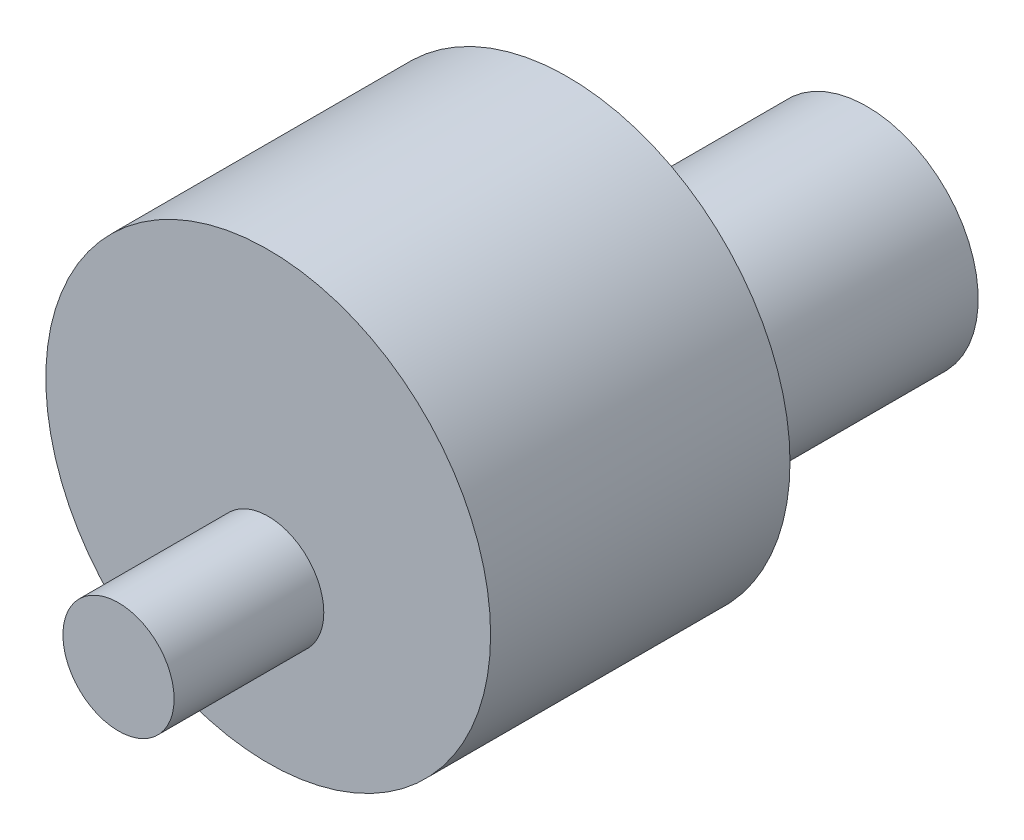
ISO-10303-21;
HEADER;
FILE_DESCRIPTION(('STEP AP214'),'2;1');
FILE_NAME('part.step','',(''),(''),'','','');
FILE_SCHEMA(('AUTOMOTIVE_DESIGN { 1 0 10303 214 1 1 1 1 }'));
ENDSEC;
DATA;
#1=APPLICATION_CONTEXT('core data for automotive mechanical design processes');
#2=APPLICATION_PROTOCOL_DEFINITION('international standard','automotive_design',2000,#1);
#3=PRODUCT_CONTEXT('',#1,'mechanical');
#4=PRODUCT('Part','Part','',(#3));
#5=PRODUCT_RELATED_PRODUCT_CATEGORY('part','',(#4));
#6=PRODUCT_DEFINITION_FORMATION('','',#4);
#7=PRODUCT_DEFINITION_CONTEXT('part definition',#1,'design');
#8=PRODUCT_DEFINITION('design','',#6,#7);
#9=PRODUCT_DEFINITION_SHAPE('','',#8);
#10=(LENGTH_UNIT() NAMED_UNIT(*) SI_UNIT(.MILLI.,.METRE.));
#11=(NAMED_UNIT(*) PLANE_ANGLE_UNIT() SI_UNIT($,.RADIAN.));
#12=(NAMED_UNIT(*) SI_UNIT($,.STERADIAN.) SOLID_ANGLE_UNIT());
#13=UNCERTAINTY_MEASURE_WITH_UNIT(LENGTH_MEASURE(1.E-05),#10,'distance_accuracy_value','');
#14=(GEOMETRIC_REPRESENTATION_CONTEXT(3) GLOBAL_UNCERTAINTY_ASSIGNED_CONTEXT((#13)) GLOBAL_UNIT_ASSIGNED_CONTEXT((#10,
#11,#12)) REPRESENTATION_CONTEXT('',''));
#15=CARTESIAN_POINT('',(0.,0.,0.));
#16=DIRECTION('',(0.,0.,1.));
#17=DIRECTION('',(1.,0.,0.));
#18=AXIS2_PLACEMENT_3D('',#15,#16,#17);
#19=CARTESIAN_POINT('',(0.,0.,177.8));
#20=DIRECTION('',(0.,0.,-1.));
#21=DIRECTION('',(-1.,0.,0.));
#22=AXIS2_PLACEMENT_3D('',#19,#20,#21);
#23=CYLINDRICAL_SURFACE('',#22,132.08);
#24=CARTESIAN_POINT('',(0.,0.,177.8));
#25=DIRECTION('',(0.,0.,1.));
#26=DIRECTION('',(1.,0.,0.));
#27=AXIS2_PLACEMENT_3D('',#24,#25,#26);
#28=CIRCLE('',#27,132.08);
#29=CARTESIAN_POINT('',(132.08,0.,177.8));
#30=VERTEX_POINT('',#29);
#31=EDGE_CURVE('E42',#30,#30,#28,.T.);
#32=ORIENTED_EDGE('',*,*,#31,.F.);
#33=EDGE_LOOP('',(#32));
#34=FACE_BOUND('',#33,.T.);
#35=CARTESIAN_POINT('',(0.,0.,0.));
#36=DIRECTION('',(0.,0.,1.));
#37=DIRECTION('',(1.,0.,0.));
#38=AXIS2_PLACEMENT_3D('',#35,#36,#37);
#39=CIRCLE('',#38,132.08);
#40=CARTESIAN_POINT('',(132.08,0.,0.));
#41=VERTEX_POINT('',#40);
#42=EDGE_CURVE('E38',#41,#41,#39,.T.);
#43=ORIENTED_EDGE('',*,*,#42,.T.);
#44=EDGE_LOOP('',(#43));
#45=FACE_BOUND('',#44,.T.);
#46=ADVANCED_FACE('F35',(#34,#45),#23,.T.);
#47=CARTESIAN_POINT('',(0.,0.,177.8));
#48=DIRECTION('',(0.,0.,1.));
#49=DIRECTION('',(1.,0.,0.));
#50=AXIS2_PLACEMENT_3D('',#47,#48,#49);
#51=PLANE('',#50);
#52=CARTESIAN_POINT('',(0.,-38.1,177.8));
#53=DIRECTION('',(0.,0.,1.));
#54=DIRECTION('',(1.,0.,0.));
#55=AXIS2_PLACEMENT_3D('',#52,#53,#54);
#56=CIRCLE('',#55,33.02);
#57=CARTESIAN_POINT('',(33.02,-38.1,177.8));
#58=VERTEX_POINT('',#57);
#59=EDGE_CURVE('E52',#58,#58,#56,.T.);
#60=ORIENTED_EDGE('',*,*,#59,.F.);
#61=EDGE_LOOP('',(#60));
#62=FACE_BOUND('',#61,.T.);
#63=ORIENTED_EDGE('',*,*,#31,.T.);
#64=EDGE_LOOP('',(#63));
#65=FACE_BOUND('',#64,.T.);
#66=ADVANCED_FACE('F67',(#62,#65),#51,.T.);
#67=CARTESIAN_POINT('',(0.,0.,0.));
#68=DIRECTION('',(0.,0.,1.));
#69=DIRECTION('',(1.,0.,0.));
#70=AXIS2_PLACEMENT_3D('',#67,#68,#69);
#71=PLANE('',#70);
#72=CARTESIAN_POINT('',(0.,-38.1,0.));
#73=DIRECTION('',(0.,0.,-1.));
#74=DIRECTION('',(-1.,0.,0.));
#75=AXIS2_PLACEMENT_3D('',#72,#73,#74);
#76=CIRCLE('',#75,66.04);
#77=CARTESIAN_POINT('',(-66.04,-38.1,0.));
#78=VERTEX_POINT('',#77);
#79=EDGE_CURVE('E10',#78,#78,#76,.T.);
#80=ORIENTED_EDGE('',*,*,#79,.F.);
#81=EDGE_LOOP('',(#80));
#82=FACE_BOUND('',#81,.T.);
#83=ORIENTED_EDGE('',*,*,#42,.F.);
#84=EDGE_LOOP('',(#83));
#85=FACE_BOUND('',#84,.T.);
#86=ADVANCED_FACE('F70',(#82,#85),#71,.F.);
#87=CARTESIAN_POINT('',(0.,-38.1,-177.8));
#88=DIRECTION('',(0.,0.,1.));
#89=DIRECTION('',(1.,0.,0.));
#90=AXIS2_PLACEMENT_3D('',#87,#88,#89);
#91=CYLINDRICAL_SURFACE('',#90,66.04);
#92=CARTESIAN_POINT('',(0.,-38.1,-177.8));
#93=DIRECTION('',(0.,0.,-1.));
#94=DIRECTION('',(-1.,0.,0.));
#95=AXIS2_PLACEMENT_3D('',#92,#93,#94);
#96=CIRCLE('',#95,66.04);
#97=CARTESIAN_POINT('',(-66.04,-38.1,-177.8));
#98=VERTEX_POINT('',#97);
#99=EDGE_CURVE('E48',#98,#98,#96,.T.);
#100=ORIENTED_EDGE('',*,*,#99,.F.);
#101=EDGE_LOOP('',(#100));
#102=FACE_BOUND('',#101,.T.);
#103=ORIENTED_EDGE('',*,*,#79,.T.);
#104=EDGE_LOOP('',(#103));
#105=FACE_BOUND('',#104,.T.);
#106=ADVANCED_FACE('F80',(#102,#105),#91,.T.);
#107=CARTESIAN_POINT('',(0.,-38.1,-177.8));
#108=DIRECTION('',(0.,0.,-1.));
#109=DIRECTION('',(-1.,0.,0.));
#110=AXIS2_PLACEMENT_3D('',#107,#108,#109);
#111=PLANE('',#110);
#112=ORIENTED_EDGE('',*,*,#99,.T.);
#113=EDGE_LOOP('',(#112));
#114=FACE_BOUND('',#113,.T.);
#115=ADVANCED_FACE('F63',(#114),#111,.T.);
#116=CARTESIAN_POINT('',(0.,-38.1,266.7));
#117=DIRECTION('',(0.,0.,-1.));
#118=DIRECTION('',(-1.,0.,0.));
#119=AXIS2_PLACEMENT_3D('',#116,#117,#118);
#120=CYLINDRICAL_SURFACE('',#119,33.02);
#121=CARTESIAN_POINT('',(0.,-38.1,266.7));
#122=DIRECTION('',(0.,0.,1.));
#123=DIRECTION('',(1.,0.,0.));
#124=AXIS2_PLACEMENT_3D('',#121,#122,#123);
#125=CIRCLE('',#124,33.02);
#126=CARTESIAN_POINT('',(33.02,-38.1,266.7));
#127=VERTEX_POINT('',#126);
#128=EDGE_CURVE('E51',#127,#127,#125,.T.);
#129=ORIENTED_EDGE('',*,*,#128,.F.);
#130=EDGE_LOOP('',(#129));
#131=FACE_BOUND('',#130,.T.);
#132=ORIENTED_EDGE('',*,*,#59,.T.);
#133=EDGE_LOOP('',(#132));
#134=FACE_BOUND('',#133,.T.);
#135=ADVANCED_FACE('F60',(#131,#134),#120,.T.);
#136=CARTESIAN_POINT('',(0.,-38.1,266.7));
#137=DIRECTION('',(0.,0.,1.));
#138=DIRECTION('',(1.,0.,0.));
#139=AXIS2_PLACEMENT_3D('',#136,#137,#138);
#140=PLANE('',#139);
#141=ORIENTED_EDGE('',*,*,#128,.T.);
#142=EDGE_LOOP('',(#141));
#143=FACE_BOUND('',#142,.T.);
#144=ADVANCED_FACE('F58',(#143),#140,.T.);
#145=CLOSED_SHELL('',(#46,#66,#86,#106,#115,#135,#144));
#146=MANIFOLD_SOLID_BREP('B2',#145);
#147=ADVANCED_BREP_SHAPE_REPRESENTATION('',(#18,#146),#14);
#148=SHAPE_DEFINITION_REPRESENTATION(#9,#147);
ENDSEC;
END-ISO-10303-21;
